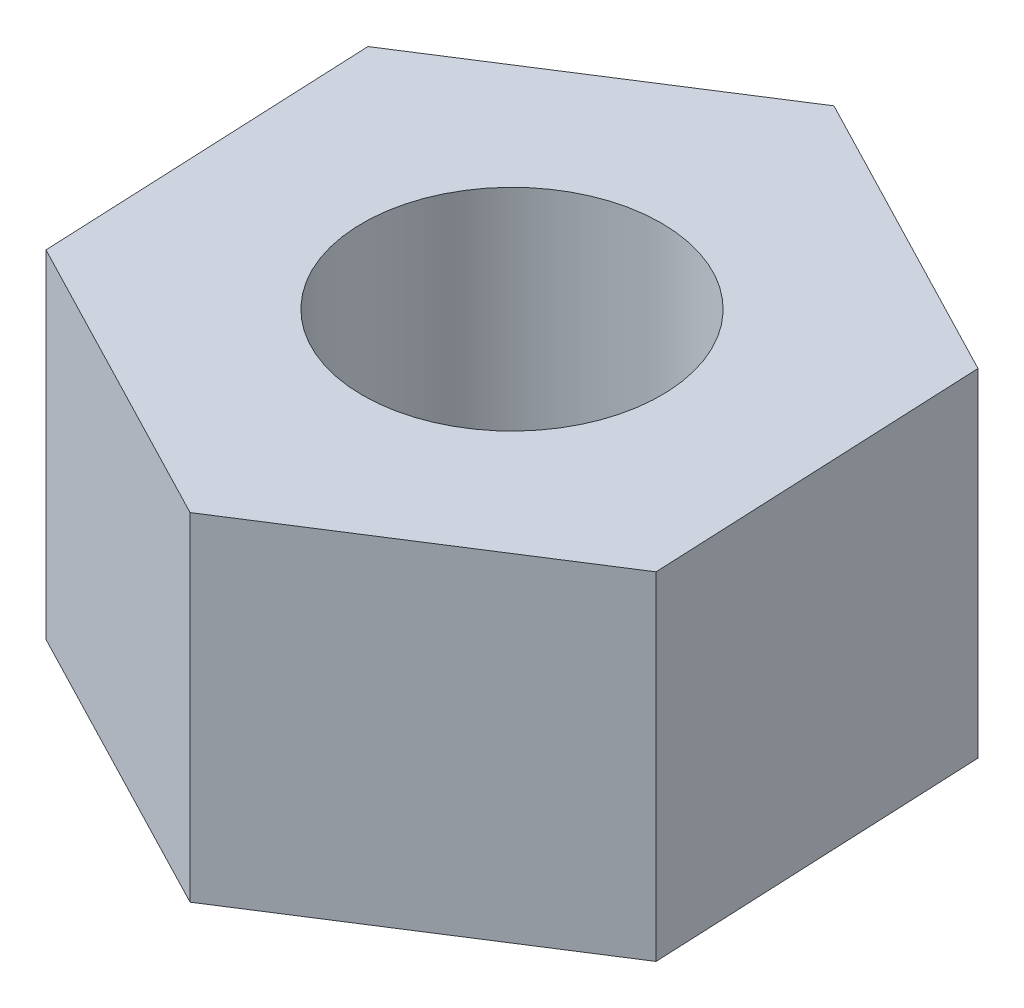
from build123d import *

# Parameters (mm, degrees)
SKETCH1_R           = 2.2479
BOSS_EXTRUDE1_DEPTH = 5.08


with BuildPart() as part:
    # Sketch1 → Boss-Extrude1 (new body)
    with BuildSketch(Plane.XZ):
        Polygon((-104.029883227, 51.438031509), (-103.801935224, 56.51291473), (-108.082939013, 59.247765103), (-112.591890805, 56.907732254), (-112.819838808, 51.832849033), (-108.538835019, 49.09799866), align=None)
        with Locations(Location((-108.310887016, 54.172881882, 0), (0, 0, 270))):
            Circle(SKETCH1_R, mode=Mode.SUBTRACT)
    extrude(amount=BOSS_EXTRUDE1_DEPTH)


solid = part.part
